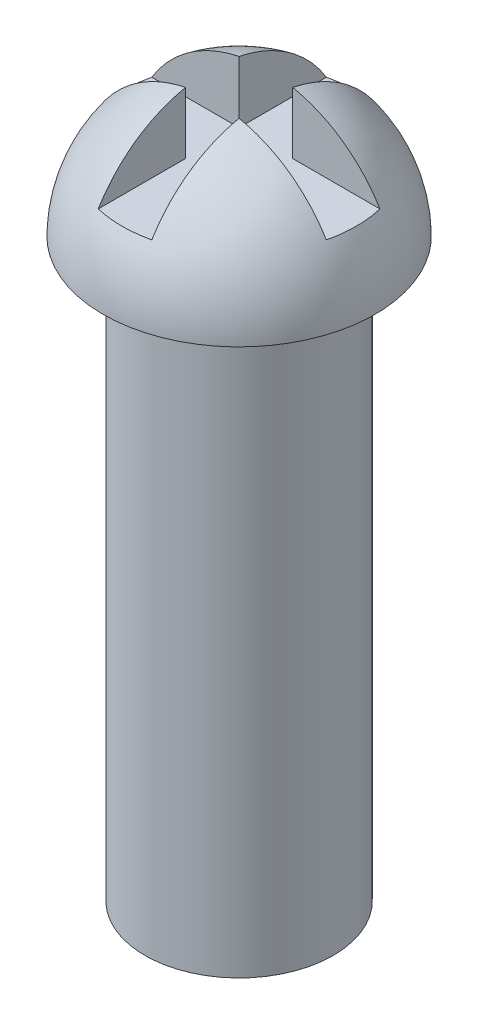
ISO-10303-21;
HEADER;
FILE_DESCRIPTION(('STEP AP214'),'2;1');
FILE_NAME('part.step','',(''),(''),'','','');
FILE_SCHEMA(('AUTOMOTIVE_DESIGN { 1 0 10303 214 1 1 1 1 }'));
ENDSEC;
DATA;
#1=APPLICATION_CONTEXT('core data for automotive mechanical design processes');
#2=APPLICATION_PROTOCOL_DEFINITION('international standard','automotive_design',2000,#1);
#3=PRODUCT_CONTEXT('',#1,'mechanical');
#4=PRODUCT('Part','Part','',(#3));
#5=PRODUCT_RELATED_PRODUCT_CATEGORY('part','',(#4));
#6=PRODUCT_DEFINITION_FORMATION('','',#4);
#7=PRODUCT_DEFINITION_CONTEXT('part definition',#1,'design');
#8=PRODUCT_DEFINITION('design','',#6,#7);
#9=PRODUCT_DEFINITION_SHAPE('','',#8);
#10=(LENGTH_UNIT() NAMED_UNIT(*) SI_UNIT(.MILLI.,.METRE.));
#11=(NAMED_UNIT(*) PLANE_ANGLE_UNIT() SI_UNIT($,.RADIAN.));
#12=(NAMED_UNIT(*) SI_UNIT($,.STERADIAN.) SOLID_ANGLE_UNIT());
#13=UNCERTAINTY_MEASURE_WITH_UNIT(LENGTH_MEASURE(1.E-05),#10,'distance_accuracy_value','');
#14=(GEOMETRIC_REPRESENTATION_CONTEXT(3) GLOBAL_UNCERTAINTY_ASSIGNED_CONTEXT((#13)) GLOBAL_UNIT_ASSIGNED_CONTEXT((#10,
#11,#12)) REPRESENTATION_CONTEXT('',''));
#15=CARTESIAN_POINT('',(0.,0.,0.));
#16=DIRECTION('',(0.,0.,1.));
#17=DIRECTION('',(1.,0.,0.));
#18=AXIS2_PLACEMENT_3D('',#15,#16,#17);
#19=CARTESIAN_POINT('',(0.,-0.0767715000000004,0.));
#20=DIRECTION('',(0.,1.,0.));
#21=DIRECTION('',(1.,0.,0.));
#22=AXIS2_PLACEMENT_3D('',#19,#20,#21);
#23=SPHERICAL_SURFACE('',#22,5.1567715);
#24=CARTESIAN_POINT('',(0.,0.,0.));
#25=DIRECTION('',(0.,1.,0.));
#26=DIRECTION('',(-1.,0.,0.));
#27=AXIS2_PLACEMENT_3D('',#24,#25,#26);
#28=CIRCLE('',#27,5.1562);
#29=CARTESIAN_POINT('',(-5.1562,0.,0.));
#30=VERTEX_POINT('',#29);
#31=EDGE_CURVE('E147',#30,#30,#28,.T.);
#32=ORIENTED_EDGE('',*,*,#31,.T.);
#33=EDGE_LOOP('',(#32));
#34=FACE_BOUND('',#33,.T.);
#35=CARTESIAN_POINT('',(0.,2.54,0.));
#36=DIRECTION('',(0.,1.,0.));
#37=DIRECTION('',(-1.,0.,0.));
#38=AXIS2_PLACEMENT_3D('',#35,#36,#37);
#39=CIRCLE('',#38,4.44351203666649);
#40=CARTESIAN_POINT('',(4.32579972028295,2.54,-1.016));
#41=VERTEX_POINT('',#40);
#42=CARTESIAN_POINT('',(4.32579972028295,2.54,1.016));
#43=VERTEX_POINT('',#42);
#44=EDGE_CURVE('E100',#41,#43,#39,.F.);
#45=ORIENTED_EDGE('',*,*,#44,.T.);
#46=CARTESIAN_POINT('',(0.,-0.0767715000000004,1.016));
#47=DIRECTION('',(0.,0.,-1.));
#48=DIRECTION('',(-1.,0.,0.));
#49=AXIS2_PLACEMENT_3D('',#46,#47,#48);
#50=CIRCLE('',#49,5.05569345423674);
#51=CARTESIAN_POINT('',(1.016,4.87578140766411,1.016));
#52=VERTEX_POINT('',#51);
#53=EDGE_CURVE('E126',#43,#52,#50,.F.);
#54=ORIENTED_EDGE('',*,*,#53,.T.);
#55=CARTESIAN_POINT('',(1.016,-0.0767715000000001,0.));
#56=DIRECTION('',(1.,0.,0.));
#57=DIRECTION('',(0.,1.,0.));
#58=AXIS2_PLACEMENT_3D('',#55,#56,#57);
#59=CIRCLE('',#58,5.05569345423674);
#60=CARTESIAN_POINT('',(1.016,2.54,4.32579972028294));
#61=VERTEX_POINT('',#60);
#62=EDGE_CURVE('E151',#61,#52,#59,.F.);
#63=ORIENTED_EDGE('',*,*,#62,.F.);
#64=CARTESIAN_POINT('',(0.,2.54,0.));
#65=DIRECTION('',(0.,1.,0.));
#66=DIRECTION('',(-1.,0.,0.));
#67=AXIS2_PLACEMENT_3D('',#64,#65,#66);
#68=CIRCLE('',#67,4.44351203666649);
#69=CARTESIAN_POINT('',(-1.016,2.54,4.32579972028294));
#70=VERTEX_POINT('',#69);
#71=EDGE_CURVE('E141',#61,#70,#68,.F.);
#72=ORIENTED_EDGE('',*,*,#71,.T.);
#73=CARTESIAN_POINT('',(-1.016,-0.0767714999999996,0.));
#74=DIRECTION('',(-1.,0.,0.));
#75=DIRECTION('',(0.,-1.,0.));
#76=AXIS2_PLACEMENT_3D('',#73,#74,#75);
#77=CIRCLE('',#76,5.05569345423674);
#78=CARTESIAN_POINT('',(-1.016,4.87578140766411,1.016));
#79=VERTEX_POINT('',#78);
#80=EDGE_CURVE('E142',#79,#70,#77,.F.);
#81=ORIENTED_EDGE('',*,*,#80,.F.);
#82=CARTESIAN_POINT('',(-4.32579972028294,2.54,1.016));
#83=VERTEX_POINT('',#82);
#84=EDGE_CURVE('E121',#79,#83,#50,.F.);
#85=ORIENTED_EDGE('',*,*,#84,.T.);
#86=CARTESIAN_POINT('',(-4.32579972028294,2.54,-1.016));
#87=VERTEX_POINT('',#86);
#88=EDGE_CURVE('E108',#83,#87,#39,.F.);
#89=ORIENTED_EDGE('',*,*,#88,.T.);
#90=CARTESIAN_POINT('',(0.,-0.0767715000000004,-1.016));
#91=DIRECTION('',(0.,0.,1.));
#92=DIRECTION('',(1.,0.,0.));
#93=AXIS2_PLACEMENT_3D('',#90,#91,#92);
#94=CIRCLE('',#93,5.05569345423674);
#95=CARTESIAN_POINT('',(-1.016,4.87578140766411,-1.016));
#96=VERTEX_POINT('',#95);
#97=EDGE_CURVE('E107',#87,#96,#94,.F.);
#98=ORIENTED_EDGE('',*,*,#97,.T.);
#99=CARTESIAN_POINT('',(-1.016,2.54,-4.32579972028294));
#100=VERTEX_POINT('',#99);
#101=EDGE_CURVE('E131',#100,#96,#77,.F.);
#102=ORIENTED_EDGE('',*,*,#101,.F.);
#103=CARTESIAN_POINT('',(1.016,2.54,-4.32579972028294));
#104=VERTEX_POINT('',#103);
#105=EDGE_CURVE('E145',#100,#104,#68,.F.);
#106=ORIENTED_EDGE('',*,*,#105,.T.);
#107=CARTESIAN_POINT('',(1.016,4.87578140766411,-1.016));
#108=VERTEX_POINT('',#107);
#109=EDGE_CURVE('E120',#108,#104,#59,.F.);
#110=ORIENTED_EDGE('',*,*,#109,.F.);
#111=EDGE_CURVE('E112',#108,#41,#94,.F.);
#112=ORIENTED_EDGE('',*,*,#111,.T.);
#113=EDGE_LOOP('',(#45,#54,#63,#72,#81,#85,#89,#98,#102,#106,#110,#112));
#114=FACE_BOUND('',#113,.T.);
#115=ADVANCED_FACE('F37',(#34,#114),#23,.T.);
#116=CARTESIAN_POINT('',(1.016,2.54,-5.1562));
#117=DIRECTION('',(1.,0.,0.));
#118=DIRECTION('',(0.,1.,0.));
#119=AXIS2_PLACEMENT_3D('',#116,#117,#118);
#120=PLANE('',#119);
#121=DIRECTION('',(0.,1.,0.));
#122=VECTOR('',#121,1.);
#123=CARTESIAN_POINT('',(1.016,2.54,1.016));
#124=LINE('',#123,#122);
#125=CARTESIAN_POINT('',(1.016,2.54,1.016));
#126=VERTEX_POINT('',#125);
#127=EDGE_CURVE('E124',#126,#52,#124,.T.);
#128=ORIENTED_EDGE('',*,*,#127,.F.);
#129=DIRECTION('',(0.,0.,1.));
#130=VECTOR('',#129,1.);
#131=CARTESIAN_POINT('',(1.016,2.54,-5.1562));
#132=LINE('',#131,#130);
#133=EDGE_CURVE('E155',#126,#61,#132,.T.);
#134=ORIENTED_EDGE('',*,*,#133,.T.);
#135=ORIENTED_EDGE('',*,*,#62,.T.);
#136=EDGE_LOOP('',(#128,#134,#135));
#137=FACE_BOUND('',#136,.T.);
#138=ADVANCED_FACE('F185',(#137),#120,.F.);
#139=DIRECTION('',(0.,-1.,0.));
#140=VECTOR('',#139,1.);
#141=CARTESIAN_POINT('',(1.016,2.54,-1.016));
#142=LINE('',#141,#140);
#143=CARTESIAN_POINT('',(1.016,2.54,-1.016));
#144=VERTEX_POINT('',#143);
#145=EDGE_CURVE('E114',#108,#144,#142,.T.);
#146=ORIENTED_EDGE('',*,*,#145,.F.);
#147=ORIENTED_EDGE('',*,*,#109,.T.);
#148=EDGE_CURVE('E158',#104,#144,#132,.T.);
#149=ORIENTED_EDGE('',*,*,#148,.T.);
#150=EDGE_LOOP('',(#146,#147,#149));
#151=FACE_BOUND('',#150,.T.);
#152=ADVANCED_FACE('F190',(#151),#120,.F.);
#153=CARTESIAN_POINT('',(-1.016,4.97892195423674,-5.1562));
#154=DIRECTION('',(-1.,0.,0.));
#155=DIRECTION('',(0.,-1.,0.));
#156=AXIS2_PLACEMENT_3D('',#153,#154,#155);
#157=PLANE('',#156);
#158=DIRECTION('',(0.,-1.,0.));
#159=VECTOR('',#158,1.);
#160=CARTESIAN_POINT('',(-1.016,4.97892195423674,1.016));
#161=LINE('',#160,#159);
#162=CARTESIAN_POINT('',(-1.016,2.54,1.016));
#163=VERTEX_POINT('',#162);
#164=EDGE_CURVE('E11',#79,#163,#161,.T.);
#165=ORIENTED_EDGE('',*,*,#164,.F.);
#166=ORIENTED_EDGE('',*,*,#80,.T.);
#167=DIRECTION('',(0.,0.,1.));
#168=VECTOR('',#167,1.);
#169=CARTESIAN_POINT('',(-1.016,2.54,-5.1562));
#170=LINE('',#169,#168);
#171=EDGE_CURVE('E156',#163,#70,#170,.T.);
#172=ORIENTED_EDGE('',*,*,#171,.F.);
#173=EDGE_LOOP('',(#165,#166,#172));
#174=FACE_BOUND('',#173,.T.);
#175=ADVANCED_FACE('F182',(#174),#157,.F.);
#176=DIRECTION('',(0.,1.,0.));
#177=VECTOR('',#176,1.);
#178=CARTESIAN_POINT('',(-1.016,4.97892195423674,-1.016));
#179=LINE('',#178,#177);
#180=CARTESIAN_POINT('',(-1.016,2.54,-1.016));
#181=VERTEX_POINT('',#180);
#182=EDGE_CURVE('E44',#181,#96,#179,.T.);
#183=ORIENTED_EDGE('',*,*,#182,.F.);
#184=EDGE_CURVE('E140',#100,#181,#170,.T.);
#185=ORIENTED_EDGE('',*,*,#184,.F.);
#186=ORIENTED_EDGE('',*,*,#101,.T.);
#187=EDGE_LOOP('',(#183,#185,#186));
#188=FACE_BOUND('',#187,.T.);
#189=ADVANCED_FACE('F138',(#188),#157,.F.);
#190=CARTESIAN_POINT('',(5.1562,0.,0.));
#191=DIRECTION('',(0.,-1.,0.));
#192=DIRECTION('',(1.,0.,0.));
#193=AXIS2_PLACEMENT_3D('',#190,#191,#192);
#194=PLANE('',#193);
#195=CARTESIAN_POINT('',(0.,0.,0.));
#196=DIRECTION('',(0.,1.,0.));
#197=DIRECTION('',(-1.,0.,0.));
#198=AXIS2_PLACEMENT_3D('',#195,#196,#197);
#199=CIRCLE('',#198,3.57187500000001);
#200=CARTESIAN_POINT('',(-3.57187500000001,0.,0.));
#201=VERTEX_POINT('',#200);
#202=EDGE_CURVE('E164',#201,#201,#199,.T.);
#203=ORIENTED_EDGE('',*,*,#202,.T.);
#204=EDGE_LOOP('',(#203));
#205=FACE_BOUND('',#204,.T.);
#206=ORIENTED_EDGE('',*,*,#31,.F.);
#207=EDGE_LOOP('',(#206));
#208=FACE_BOUND('',#207,.T.);
#209=ADVANCED_FACE('F172',(#205,#208),#194,.T.);
#210=CARTESIAN_POINT('',(0.,10.1105238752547,0.));
#211=DIRECTION('',(0.,1.,0.));
#212=DIRECTION('',(-1.,0.,0.));
#213=AXIS2_PLACEMENT_3D('',#210,#211,#212);
#214=CYLINDRICAL_SURFACE('',#213,3.571875);
#215=CARTESIAN_POINT('',(0.,-21.844,0.));
#216=DIRECTION('',(0.,1.,0.));
#217=DIRECTION('',(-1.,0.,0.));
#218=AXIS2_PLACEMENT_3D('',#215,#216,#217);
#219=CIRCLE('',#218,3.571875);
#220=CARTESIAN_POINT('',(-3.571875,-21.844,0.));
#221=VERTEX_POINT('',#220);
#222=EDGE_CURVE('E162',#221,#221,#219,.T.);
#223=ORIENTED_EDGE('',*,*,#222,.T.);
#224=EDGE_LOOP('',(#223));
#225=FACE_BOUND('',#224,.T.);
#226=ORIENTED_EDGE('',*,*,#202,.F.);
#227=EDGE_LOOP('',(#226));
#228=FACE_BOUND('',#227,.T.);
#229=ADVANCED_FACE('F174',(#225,#228),#214,.T.);
#230=CARTESIAN_POINT('',(3.571875,-21.844,0.));
#231=DIRECTION('',(0.,-1.,0.));
#232=DIRECTION('',(1.,0.,0.));
#233=AXIS2_PLACEMENT_3D('',#230,#231,#232);
#234=PLANE('',#233);
#235=ORIENTED_EDGE('',*,*,#222,.F.);
#236=EDGE_LOOP('',(#235));
#237=FACE_BOUND('',#236,.T.);
#238=ADVANCED_FACE('F178',(#237),#234,.T.);
#239=CARTESIAN_POINT('',(1.016,2.54,-5.1562));
#240=DIRECTION('',(0.,1.,0.));
#241=DIRECTION('',(-1.,0.,0.));
#242=AXIS2_PLACEMENT_3D('',#239,#240,#241);
#243=PLANE('',#242);
#244=DIRECTION('',(1.,0.,0.));
#245=VECTOR('',#244,1.);
#246=CARTESIAN_POINT('',(-5.1562,2.54,1.016));
#247=LINE('',#246,#245);
#248=EDGE_CURVE('E58',#83,#163,#247,.T.);
#249=ORIENTED_EDGE('',*,*,#248,.T.);
#250=ORIENTED_EDGE('',*,*,#171,.T.);
#251=ORIENTED_EDGE('',*,*,#71,.F.);
#252=ORIENTED_EDGE('',*,*,#133,.F.);
#253=EDGE_CURVE('E103',#126,#43,#247,.T.);
#254=ORIENTED_EDGE('',*,*,#253,.T.);
#255=ORIENTED_EDGE('',*,*,#44,.F.);
#256=DIRECTION('',(-1.,0.,0.));
#257=VECTOR('',#256,1.);
#258=CARTESIAN_POINT('',(-5.1562,2.54,-1.016));
#259=LINE('',#258,#257);
#260=EDGE_CURVE('E51',#41,#144,#259,.T.);
#261=ORIENTED_EDGE('',*,*,#260,.T.);
#262=ORIENTED_EDGE('',*,*,#148,.F.);
#263=ORIENTED_EDGE('',*,*,#105,.F.);
#264=ORIENTED_EDGE('',*,*,#184,.T.);
#265=EDGE_CURVE('E116',#181,#87,#259,.T.);
#266=ORIENTED_EDGE('',*,*,#265,.T.);
#267=ORIENTED_EDGE('',*,*,#88,.F.);
#268=EDGE_LOOP('',(#249,#250,#251,#252,#254,#255,#261,#262,#263,#264,#266,#267));
#269=FACE_BOUND('',#268,.T.);
#270=ADVANCED_FACE('F101',(#269),#243,.T.);
#271=CARTESIAN_POINT('',(-5.1562,4.97892195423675,-1.016));
#272=DIRECTION('',(0.,0.,1.));
#273=DIRECTION('',(1.,0.,0.));
#274=AXIS2_PLACEMENT_3D('',#271,#272,#273);
#275=PLANE('',#274);
#276=ORIENTED_EDGE('',*,*,#265,.F.);
#277=ORIENTED_EDGE('',*,*,#182,.T.);
#278=ORIENTED_EDGE('',*,*,#97,.F.);
#279=EDGE_LOOP('',(#276,#277,#278));
#280=FACE_BOUND('',#279,.T.);
#281=ADVANCED_FACE('F153',(#280),#275,.T.);
#282=CARTESIAN_POINT('',(-5.1562,4.97892195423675,1.016));
#283=DIRECTION('',(0.,0.,-1.));
#284=DIRECTION('',(-1.,0.,0.));
#285=AXIS2_PLACEMENT_3D('',#282,#283,#284);
#286=PLANE('',#285);
#287=ORIENTED_EDGE('',*,*,#164,.T.);
#288=ORIENTED_EDGE('',*,*,#248,.F.);
#289=ORIENTED_EDGE('',*,*,#84,.F.);
#290=EDGE_LOOP('',(#287,#288,#289));
#291=FACE_BOUND('',#290,.T.);
#292=ADVANCED_FACE('F200',(#291),#286,.T.);
#293=ORIENTED_EDGE('',*,*,#253,.F.);
#294=ORIENTED_EDGE('',*,*,#127,.T.);
#295=ORIENTED_EDGE('',*,*,#53,.F.);
#296=EDGE_LOOP('',(#293,#294,#295));
#297=FACE_BOUND('',#296,.T.);
#298=ADVANCED_FACE('F251',(#297),#286,.T.);
#299=ORIENTED_EDGE('',*,*,#145,.T.);
#300=ORIENTED_EDGE('',*,*,#260,.F.);
#301=ORIENTED_EDGE('',*,*,#111,.F.);
#302=EDGE_LOOP('',(#299,#300,#301));
#303=FACE_BOUND('',#302,.T.);
#304=ADVANCED_FACE('F111',(#303),#275,.T.);
#305=CLOSED_SHELL('',(#115,#138,#152,#175,#189,#209,#229,#238,#270,#281,#292,#298,#304));
#306=MANIFOLD_SOLID_BREP('B2',#305);
#307=ADVANCED_BREP_SHAPE_REPRESENTATION('',(#18,#306),#14);
#308=SHAPE_DEFINITION_REPRESENTATION(#9,#307);
ENDSEC;
END-ISO-10303-21;
